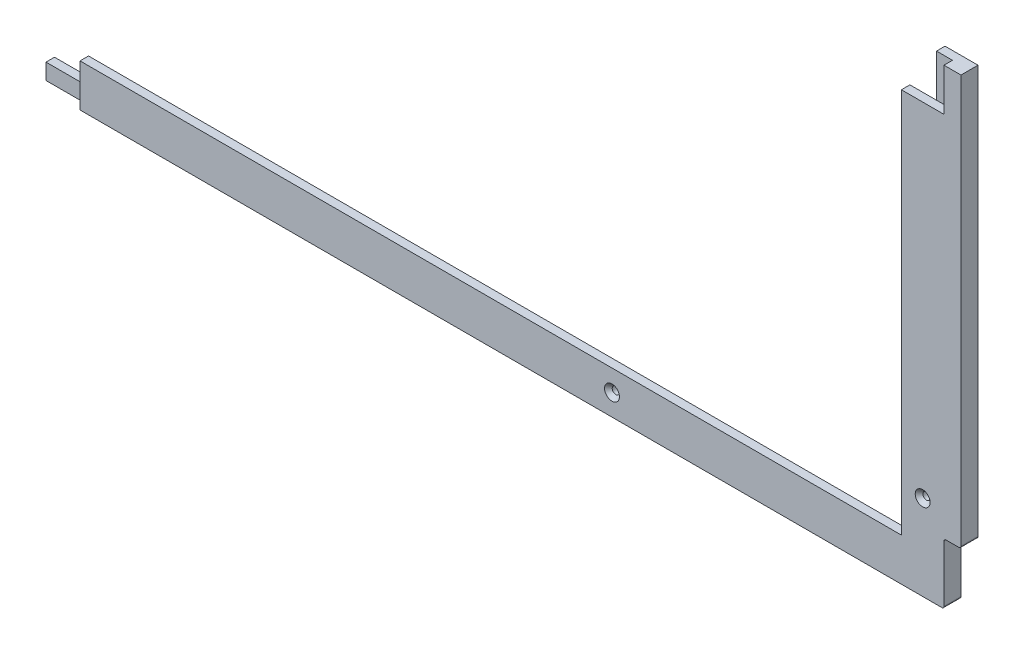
from build123d import *

# Parameters (mm, degrees)
SKIZZE1_W                                            = 832
SKIZZE1_H                                            = 422.5
SKIZZE1_W_2                                          = 792
SKIZZE1_H_2                                          = 382.5
AUFSATZ_LINEAR_AUSTRAGEN1_DEPTH                      = 8
VERRUNDUNG1_R                                        = 1
SKIZZE2_W                                            = 817
SKIZZE2_H                                            = 407.5
SCHNITT_LINEAR_AUSTRAGEN1_DEPTH                      = 4
FORMSENKUNG_F_R_M3_SENKSCHRAUBE_MIT_INNE_D           = 3.4
FORMSENKUNG_F_R_M3_SENKSCHRAUBE_MIT_INNE_CSINK_D     = 7
FORMSENKUNG_F_R_M3_SENKSCHRAUBE_MIT_INNE_CSINK_ANGLE = 90
SCHNITT_LINEAR_AUSTRAGEN2_DEPTH                      = 467.633220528
SCHNITT_LINEAR_AUSTRAGEN3_DEPTH                      = 467.633220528
SCHNITT_LINEAR_AUSTRAGEN4_DEPTH                      = 467.633220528
SCHNITT_LINEAR_AUSTRAGEN4_DEPTH_BACK                 = 467.633220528
SKIZZE8_W                                            = 8
SKIZZE8_H                                            = 192.75
AUFSATZ_LINEAR_AUSTRAGEN2_DEPTH                      = 8
VERRUNDUNG2_R                                        = 1


with BuildPart() as part:
    # Skizze1 → Aufsatz-Linear austragen1 (new body)
    with BuildSketch(Plane.XY):
        Rectangle(SKIZZE1_W, SKIZZE1_H)
        Rectangle(SKIZZE1_W_2, SKIZZE1_H_2, mode=Mode.SUBTRACT)
    extrude(amount=AUFSATZ_LINEAR_AUSTRAGEN1_DEPTH)

    # Verrundung1
    verrundung1_edges = [part.edges().sort_by_distance(p)[0] for p in [
        (416, -211.25, 4),
        (-416, -211.25, 4),
        (-416, 211.25, 4),
        (416, 211.25, 4),
    ]]
    fillet(verrundung1_edges, radius=VERRUNDUNG1_R)

    # Skizze2 → Schnitt-Linear austragen1 (cut)
    with BuildSketch(Plane(origin=(0, 0, 0), x_dir=(-1, 0, 0), z_dir=(0, 0, -1))):
        Rectangle(SKIZZE2_W, SKIZZE2_H)
    extrude(amount=-SCHNITT_LINEAR_AUSTRAGEN1_DEPTH, mode=Mode.SUBTRACT)

    # Formsenkung f_r M3 Senkschraube mit Inne (through all)
    with Locations(Plane.XY.offset(8)):
        with Locations((-260, -201.25), (260, -201.25), (260, 201.25), (-260, 201.25), (406, 171.25), (406, -171.25), (-406, -171.25), (-406, 171.25), (-406, 0), (406, 0), (0, -201.25), (0, 201.25)):
            CounterSinkHole(FORMSENKUNG_F_R_M3_SENKSCHRAUBE_MIT_INNE_D / 2, FORMSENKUNG_F_R_M3_SENKSCHRAUBE_MIT_INNE_CSINK_D / 2, counter_sink_angle=FORMSENKUNG_F_R_M3_SENKSCHRAUBE_MIT_INNE_CSINK_ANGLE)

    # Skizze5 → Schnitt-Linear austragen2 (cut, through all)
    with BuildSketch(Plane(origin=(0, 0, 0), x_dir=(0, 0, -1), z_dir=(1, 0, 0))):
        Polygon((-8, 211.25), (-8, -10), (-4, -10), (-4, 10), (0, 10), (0, 211.25), align=None)
    extrude(amount=SCHNITT_LINEAR_AUSTRAGEN2_DEPTH, mode=Mode.SUBTRACT)

    # Skizze6 → Schnitt-Linear austragen3 (cut, through all)
    with BuildSketch(Plane(origin=(0, 0, 0), x_dir=(0, 0, -1), z_dir=(1, 0, 0))):
        Polygon((-8, 211.25), (-8, -10), (-4, -10), (-4, 10), (0, 10), (0, 211.25), align=None)
    extrude(amount=-SCHNITT_LINEAR_AUSTRAGEN3_DEPTH, mode=Mode.SUBTRACT)

    # Skizze7 → Schnitt-Linear austragen4 (cut, two sides: drawn at the far end of the back side and taken through both)
    with BuildSketch(Plane(origin=(0, 0, 0), x_dir=(1, 0, 0), z_dir=(0, 1, 0)).offset(-SCHNITT_LINEAR_AUSTRAGEN4_DEPTH_BACK)):
        Polygon((-416, -8), (-416, 0), (-10, 0), (-10, -4), (10, -4), (10, -8), align=None)
    extrude(amount=SCHNITT_LINEAR_AUSTRAGEN4_DEPTH + SCHNITT_LINEAR_AUSTRAGEN4_DEPTH_BACK, mode=Mode.SUBTRACT)

    # Skizze8 → Aufsatz-Linear austragen2 (add)
    with BuildSketch(Plane(origin=(0, 0, 0), x_dir=(-1, 0, 0), z_dir=(0, 0, -1))):
        with Locations((-420, -86.375)):
            Rectangle(SKIZZE8_W, SKIZZE8_H)
    extrude(amount=-AUFSATZ_LINEAR_AUSTRAGEN2_DEPTH)

    # Verrundung2
    verrundung2_edges = [part.edges().sort_by_distance(p)[0] for p in [
        (416, -182.75, 4),
        (424, -182.75, 4),
    ]]
    fillet(verrundung2_edges, radius=VERRUNDUNG2_R)


solid = part.part
